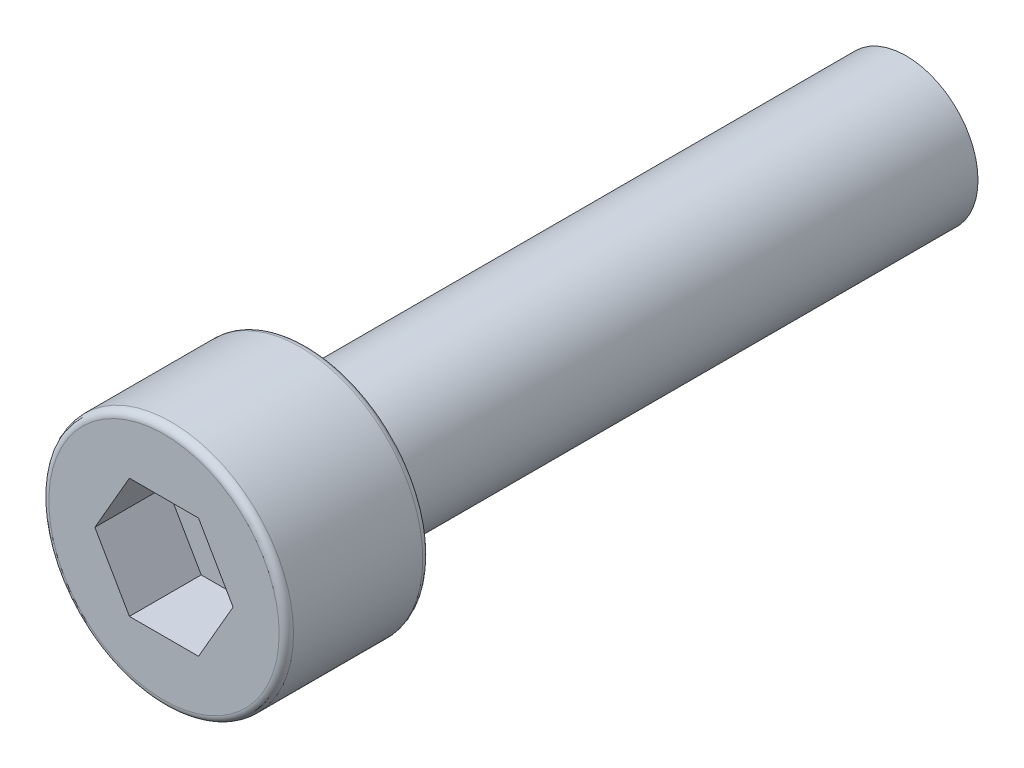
ISO-10303-21;
HEADER;
FILE_DESCRIPTION(('STEP AP214'),'2;1');
FILE_NAME('part.step','',(''),(''),'','','');
FILE_SCHEMA(('AUTOMOTIVE_DESIGN { 1 0 10303 214 1 1 1 1 }'));
ENDSEC;
DATA;
#1=APPLICATION_CONTEXT('core data for automotive mechanical design processes');
#2=APPLICATION_PROTOCOL_DEFINITION('international standard','automotive_design',2000,#1);
#3=PRODUCT_CONTEXT('',#1,'mechanical');
#4=PRODUCT('Part','Part','',(#3));
#5=PRODUCT_RELATED_PRODUCT_CATEGORY('part','',(#4));
#6=PRODUCT_DEFINITION_FORMATION('','',#4);
#7=PRODUCT_DEFINITION_CONTEXT('part definition',#1,'design');
#8=PRODUCT_DEFINITION('design','',#6,#7);
#9=PRODUCT_DEFINITION_SHAPE('','',#8);
#10=(LENGTH_UNIT() NAMED_UNIT(*) SI_UNIT(.MILLI.,.METRE.));
#11=(NAMED_UNIT(*) PLANE_ANGLE_UNIT() SI_UNIT($,.RADIAN.));
#12=(NAMED_UNIT(*) SI_UNIT($,.STERADIAN.) SOLID_ANGLE_UNIT());
#13=UNCERTAINTY_MEASURE_WITH_UNIT(LENGTH_MEASURE(1.E-05),#10,'distance_accuracy_value','');
#14=(GEOMETRIC_REPRESENTATION_CONTEXT(3) GLOBAL_UNCERTAINTY_ASSIGNED_CONTEXT((#13)) GLOBAL_UNIT_ASSIGNED_CONTEXT((#10,
#11,#12)) REPRESENTATION_CONTEXT('',''));
#15=CARTESIAN_POINT('',(0.,0.,0.));
#16=DIRECTION('',(0.,0.,1.));
#17=DIRECTION('',(1.,0.,0.));
#18=AXIS2_PLACEMENT_3D('',#15,#16,#17);
#19=CARTESIAN_POINT('',(0.,0.,25.));
#20=DIRECTION('',(0.,0.,-1.));
#21=DIRECTION('',(-1.,0.,0.));
#22=AXIS2_PLACEMENT_3D('',#19,#20,#21);
#23=CYLINDRICAL_SURFACE('',#22,3.);
#24=CARTESIAN_POINT('',(0.,0.,25.));
#25=DIRECTION('',(0.,0.,1.));
#26=DIRECTION('',(1.,0.,0.));
#27=AXIS2_PLACEMENT_3D('',#24,#25,#26);
#28=CIRCLE('',#27,3.);
#29=CARTESIAN_POINT('',(3.,0.,25.));
#30=VERTEX_POINT('',#29);
#31=EDGE_CURVE('E168',#30,#30,#28,.T.);
#32=ORIENTED_EDGE('',*,*,#31,.F.);
#33=EDGE_LOOP('',(#32));
#34=FACE_BOUND('',#33,.T.);
#35=CARTESIAN_POINT('',(0.,0.,0.));
#36=DIRECTION('',(0.,0.,1.));
#37=DIRECTION('',(1.,0.,0.));
#38=AXIS2_PLACEMENT_3D('',#35,#36,#37);
#39=CIRCLE('',#38,3.);
#40=CARTESIAN_POINT('',(3.,0.,0.));
#41=VERTEX_POINT('',#40);
#42=EDGE_CURVE('E159',#41,#41,#39,.T.);
#43=ORIENTED_EDGE('',*,*,#42,.T.);
#44=EDGE_LOOP('',(#43));
#45=FACE_BOUND('',#44,.T.);
#46=ADVANCED_FACE('F44',(#34,#45),#23,.T.);
#47=CARTESIAN_POINT('',(0.,0.,0.));
#48=DIRECTION('',(0.,0.,1.));
#49=DIRECTION('',(1.,0.,0.));
#50=AXIS2_PLACEMENT_3D('',#47,#48,#49);
#51=PLANE('',#50);
#52=ORIENTED_EDGE('',*,*,#42,.F.);
#53=EDGE_LOOP('',(#52));
#54=FACE_BOUND('',#53,.T.);
#55=ADVANCED_FACE('F199',(#54),#51,.F.);
#56=CARTESIAN_POINT('',(0.,0.,31.));
#57=DIRECTION('',(0.,0.,-1.));
#58=DIRECTION('',(-1.,0.,0.));
#59=AXIS2_PLACEMENT_3D('',#56,#57,#58);
#60=CYLINDRICAL_SURFACE('',#59,5.11);
#61=CARTESIAN_POINT('',(0.,0.,25.3));
#62=DIRECTION('',(0.,0.,1.));
#63=DIRECTION('',(1.,0.,0.));
#64=AXIS2_PLACEMENT_3D('',#61,#62,#63);
#65=CIRCLE('',#64,5.11);
#66=CARTESIAN_POINT('',(5.11,0.,25.3));
#67=VERTEX_POINT('',#66);
#68=EDGE_CURVE('E182',#67,#67,#65,.T.);
#69=ORIENTED_EDGE('',*,*,#68,.T.);
#70=EDGE_LOOP('',(#69));
#71=FACE_BOUND('',#70,.T.);
#72=CARTESIAN_POINT('',(0.,0.,30.7));
#73=DIRECTION('',(0.,0.,1.));
#74=DIRECTION('',(1.,0.,0.));
#75=AXIS2_PLACEMENT_3D('',#72,#73,#74);
#76=CIRCLE('',#75,5.11);
#77=CARTESIAN_POINT('',(5.11,0.,30.7));
#78=VERTEX_POINT('',#77);
#79=EDGE_CURVE('E171',#78,#78,#76,.F.);
#80=ORIENTED_EDGE('',*,*,#79,.T.);
#81=EDGE_LOOP('',(#80));
#82=FACE_BOUND('',#81,.T.);
#83=ADVANCED_FACE('F198',(#71,#82),#60,.T.);
#84=CARTESIAN_POINT('',(0.,0.,31.));
#85=DIRECTION('',(0.,0.,1.));
#86=DIRECTION('',(1.,0.,0.));
#87=AXIS2_PLACEMENT_3D('',#84,#85,#86);
#88=PLANE('',#87);
#89=CARTESIAN_POINT('',(0.,0.,31.));
#90=DIRECTION('',(0.,0.,1.));
#91=DIRECTION('',(1.,0.,0.));
#92=AXIS2_PLACEMENT_3D('',#89,#90,#91);
#93=CIRCLE('',#92,4.81);
#94=CARTESIAN_POINT('',(4.81,0.,31.));
#95=VERTEX_POINT('',#94);
#96=EDGE_CURVE('E11',#95,#95,#93,.T.);
#97=ORIENTED_EDGE('',*,*,#96,.T.);
#98=EDGE_LOOP('',(#97));
#99=FACE_BOUND('',#98,.T.);
#100=DIRECTION('',(0.5,0.866025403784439,0.));
#101=VECTOR('',#100,1.);
#102=CARTESIAN_POINT('',(1.44337567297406,-2.5,31.));
#103=LINE('',#102,#101);
#104=CARTESIAN_POINT('',(1.44337567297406,-2.5,31.));
#105=VERTEX_POINT('',#104);
#106=CARTESIAN_POINT('',(2.88675134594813,0.,31.));
#107=VERTEX_POINT('',#106);
#108=EDGE_CURVE('E62',#105,#107,#103,.T.);
#109=ORIENTED_EDGE('',*,*,#108,.F.);
#110=DIRECTION('',(1.,0.,0.));
#111=VECTOR('',#110,1.);
#112=CARTESIAN_POINT('',(-1.44337567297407,-2.5,31.));
#113=LINE('',#112,#111);
#114=CARTESIAN_POINT('',(-1.44337567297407,-2.5,31.));
#115=VERTEX_POINT('',#114);
#116=EDGE_CURVE('E152',#115,#105,#113,.T.);
#117=ORIENTED_EDGE('',*,*,#116,.F.);
#118=DIRECTION('',(0.5,-0.866025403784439,0.));
#119=VECTOR('',#118,1.);
#120=CARTESIAN_POINT('',(-2.88675134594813,0.,31.));
#121=LINE('',#120,#119);
#122=CARTESIAN_POINT('',(-2.88675134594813,0.,31.));
#123=VERTEX_POINT('',#122);
#124=EDGE_CURVE('E151',#123,#115,#121,.T.);
#125=ORIENTED_EDGE('',*,*,#124,.F.);
#126=DIRECTION('',(-0.5,-0.866025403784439,0.));
#127=VECTOR('',#126,1.);
#128=CARTESIAN_POINT('',(-1.44337567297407,2.5,31.));
#129=LINE('',#128,#127);
#130=CARTESIAN_POINT('',(-1.44337567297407,2.5,31.));
#131=VERTEX_POINT('',#130);
#132=EDGE_CURVE('E108',#131,#123,#129,.T.);
#133=ORIENTED_EDGE('',*,*,#132,.F.);
#134=DIRECTION('',(-1.,0.,0.));
#135=VECTOR('',#134,1.);
#136=CARTESIAN_POINT('',(1.44337567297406,2.5,31.));
#137=LINE('',#136,#135);
#138=CARTESIAN_POINT('',(1.44337567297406,2.5,31.));
#139=VERTEX_POINT('',#138);
#140=EDGE_CURVE('E144',#139,#131,#137,.T.);
#141=ORIENTED_EDGE('',*,*,#140,.F.);
#142=DIRECTION('',(-0.5,0.866025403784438,0.));
#143=VECTOR('',#142,1.);
#144=CARTESIAN_POINT('',(2.88675134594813,0.,31.));
#145=LINE('',#144,#143);
#146=EDGE_CURVE('E143',#107,#139,#145,.T.);
#147=ORIENTED_EDGE('',*,*,#146,.F.);
#148=EDGE_LOOP('',(#109,#117,#125,#133,#141,#147));
#149=FACE_BOUND('',#148,.T.);
#150=ADVANCED_FACE('F200',(#99,#149),#88,.T.);
#151=CARTESIAN_POINT('',(0.,0.,25.));
#152=DIRECTION('',(0.,0.,1.));
#153=DIRECTION('',(1.,0.,0.));
#154=AXIS2_PLACEMENT_3D('',#151,#152,#153);
#155=PLANE('',#154);
#156=CARTESIAN_POINT('',(0.,0.,25.));
#157=DIRECTION('',(0.,0.,1.));
#158=DIRECTION('',(1.,0.,0.));
#159=AXIS2_PLACEMENT_3D('',#156,#157,#158);
#160=CIRCLE('',#159,4.81);
#161=CARTESIAN_POINT('',(4.81,0.,25.));
#162=VERTEX_POINT('',#161);
#163=EDGE_CURVE('E53',#162,#162,#160,.F.);
#164=ORIENTED_EDGE('',*,*,#163,.T.);
#165=EDGE_LOOP('',(#164));
#166=FACE_BOUND('',#165,.T.);
#167=ORIENTED_EDGE('',*,*,#31,.T.);
#168=EDGE_LOOP('',(#167));
#169=FACE_BOUND('',#168,.T.);
#170=ADVANCED_FACE('F190',(#166,#169),#155,.F.);
#171=CARTESIAN_POINT('',(1.44337567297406,-2.5,28.));
#172=DIRECTION('',(0.866025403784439,-0.5,0.));
#173=DIRECTION('',(0.5,0.866025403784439,0.));
#174=AXIS2_PLACEMENT_3D('',#171,#172,#173);
#175=PLANE('',#174);
#176=ORIENTED_EDGE('',*,*,#108,.T.);
#177=DIRECTION('',(0.,0.,1.));
#178=VECTOR('',#177,1.);
#179=CARTESIAN_POINT('',(2.88675134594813,0.,28.));
#180=LINE('',#179,#178);
#181=CARTESIAN_POINT('',(2.88675134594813,0.,28.));
#182=VERTEX_POINT('',#181);
#183=EDGE_CURVE('E93',#182,#107,#180,.T.);
#184=ORIENTED_EDGE('',*,*,#183,.F.);
#185=DIRECTION('',(0.5,0.866025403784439,0.));
#186=VECTOR('',#185,1.);
#187=CARTESIAN_POINT('',(1.44337567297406,-2.5,28.));
#188=LINE('',#187,#186);
#189=CARTESIAN_POINT('',(1.44337567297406,-2.5,28.));
#190=VERTEX_POINT('',#189);
#191=EDGE_CURVE('E160',#190,#182,#188,.T.);
#192=ORIENTED_EDGE('',*,*,#191,.F.);
#193=DIRECTION('',(0.,0.,1.));
#194=VECTOR('',#193,1.);
#195=CARTESIAN_POINT('',(1.44337567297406,-2.5,28.));
#196=LINE('',#195,#194);
#197=EDGE_CURVE('E66',#190,#105,#196,.T.);
#198=ORIENTED_EDGE('',*,*,#197,.T.);
#199=EDGE_LOOP('',(#176,#184,#192,#198));
#200=FACE_BOUND('',#199,.T.);
#201=ADVANCED_FACE('F218',(#200),#175,.F.);
#202=CARTESIAN_POINT('',(-1.44337567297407,-2.5,28.));
#203=DIRECTION('',(0.,-1.,0.));
#204=DIRECTION('',(1.,0.,0.));
#205=AXIS2_PLACEMENT_3D('',#202,#203,#204);
#206=PLANE('',#205);
#207=ORIENTED_EDGE('',*,*,#116,.T.);
#208=ORIENTED_EDGE('',*,*,#197,.F.);
#209=DIRECTION('',(1.,0.,0.));
#210=VECTOR('',#209,1.);
#211=CARTESIAN_POINT('',(-1.44337567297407,-2.5,28.));
#212=LINE('',#211,#210);
#213=CARTESIAN_POINT('',(-1.44337567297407,-2.5,28.));
#214=VERTEX_POINT('',#213);
#215=EDGE_CURVE('E125',#214,#190,#212,.T.);
#216=ORIENTED_EDGE('',*,*,#215,.F.);
#217=DIRECTION('',(0.,0.,1.));
#218=VECTOR('',#217,1.);
#219=CARTESIAN_POINT('',(-1.44337567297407,-2.5,28.));
#220=LINE('',#219,#218);
#221=EDGE_CURVE('E111',#214,#115,#220,.T.);
#222=ORIENTED_EDGE('',*,*,#221,.T.);
#223=EDGE_LOOP('',(#207,#208,#216,#222));
#224=FACE_BOUND('',#223,.T.);
#225=ADVANCED_FACE('F222',(#224),#206,.F.);
#226=CARTESIAN_POINT('',(-2.88675134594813,0.,28.));
#227=DIRECTION('',(-0.866025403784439,-0.5,0.));
#228=DIRECTION('',(0.5,-0.866025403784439,0.));
#229=AXIS2_PLACEMENT_3D('',#226,#227,#228);
#230=PLANE('',#229);
#231=ORIENTED_EDGE('',*,*,#124,.T.);
#232=ORIENTED_EDGE('',*,*,#221,.F.);
#233=DIRECTION('',(0.5,-0.866025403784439,0.));
#234=VECTOR('',#233,1.);
#235=CARTESIAN_POINT('',(-2.88675134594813,0.,28.));
#236=LINE('',#235,#234);
#237=CARTESIAN_POINT('',(-2.88675134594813,0.,28.));
#238=VERTEX_POINT('',#237);
#239=EDGE_CURVE('E120',#238,#214,#236,.T.);
#240=ORIENTED_EDGE('',*,*,#239,.F.);
#241=DIRECTION('',(0.,0.,1.));
#242=VECTOR('',#241,1.);
#243=CARTESIAN_POINT('',(-2.88675134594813,0.,28.));
#244=LINE('',#243,#242);
#245=EDGE_CURVE('E105',#238,#123,#244,.T.);
#246=ORIENTED_EDGE('',*,*,#245,.T.);
#247=EDGE_LOOP('',(#231,#232,#240,#246));
#248=FACE_BOUND('',#247,.T.);
#249=ADVANCED_FACE('F116',(#248),#230,.F.);
#250=CARTESIAN_POINT('',(-1.44337567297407,2.5,28.));
#251=DIRECTION('',(-0.866025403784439,0.5,0.));
#252=DIRECTION('',(-0.5,-0.866025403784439,0.));
#253=AXIS2_PLACEMENT_3D('',#250,#251,#252);
#254=PLANE('',#253);
#255=ORIENTED_EDGE('',*,*,#132,.T.);
#256=ORIENTED_EDGE('',*,*,#245,.F.);
#257=DIRECTION('',(-0.5,-0.866025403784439,0.));
#258=VECTOR('',#257,1.);
#259=CARTESIAN_POINT('',(-1.44337567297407,2.5,28.));
#260=LINE('',#259,#258);
#261=CARTESIAN_POINT('',(-1.44337567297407,2.5,28.));
#262=VERTEX_POINT('',#261);
#263=EDGE_CURVE('E106',#262,#238,#260,.T.);
#264=ORIENTED_EDGE('',*,*,#263,.F.);
#265=DIRECTION('',(0.,0.,1.));
#266=VECTOR('',#265,1.);
#267=CARTESIAN_POINT('',(-1.44337567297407,2.5,28.));
#268=LINE('',#267,#266);
#269=EDGE_CURVE('E113',#262,#131,#268,.T.);
#270=ORIENTED_EDGE('',*,*,#269,.T.);
#271=EDGE_LOOP('',(#255,#256,#264,#270));
#272=FACE_BOUND('',#271,.T.);
#273=ADVANCED_FACE('F102',(#272),#254,.F.);
#274=CARTESIAN_POINT('',(1.44337567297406,2.5,28.));
#275=DIRECTION('',(0.,1.,0.));
#276=DIRECTION('',(0.,0.,1.));
#277=AXIS2_PLACEMENT_3D('',#274,#275,#276);
#278=PLANE('',#277);
#279=ORIENTED_EDGE('',*,*,#140,.T.);
#280=ORIENTED_EDGE('',*,*,#269,.F.);
#281=DIRECTION('',(-1.,0.,0.));
#282=VECTOR('',#281,1.);
#283=CARTESIAN_POINT('',(1.44337567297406,2.5,28.));
#284=LINE('',#283,#282);
#285=CARTESIAN_POINT('',(1.44337567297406,2.5,28.));
#286=VERTEX_POINT('',#285);
#287=EDGE_CURVE('E129',#286,#262,#284,.T.);
#288=ORIENTED_EDGE('',*,*,#287,.F.);
#289=DIRECTION('',(0.,0.,1.));
#290=VECTOR('',#289,1.);
#291=CARTESIAN_POINT('',(1.44337567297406,2.5,28.));
#292=LINE('',#291,#290);
#293=EDGE_CURVE('E164',#286,#139,#292,.T.);
#294=ORIENTED_EDGE('',*,*,#293,.T.);
#295=EDGE_LOOP('',(#279,#280,#288,#294));
#296=FACE_BOUND('',#295,.T.);
#297=ADVANCED_FACE('F291',(#296),#278,.F.);
#298=CARTESIAN_POINT('',(2.88675134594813,0.,28.));
#299=DIRECTION('',(0.866025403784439,0.5,0.));
#300=DIRECTION('',(-0.5,0.866025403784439,0.));
#301=AXIS2_PLACEMENT_3D('',#298,#299,#300);
#302=PLANE('',#301);
#303=ORIENTED_EDGE('',*,*,#146,.T.);
#304=ORIENTED_EDGE('',*,*,#293,.F.);
#305=DIRECTION('',(-0.5,0.866025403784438,0.));
#306=VECTOR('',#305,1.);
#307=CARTESIAN_POINT('',(2.88675134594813,0.,28.));
#308=LINE('',#307,#306);
#309=EDGE_CURVE('E135',#182,#286,#308,.T.);
#310=ORIENTED_EDGE('',*,*,#309,.F.);
#311=ORIENTED_EDGE('',*,*,#183,.T.);
#312=EDGE_LOOP('',(#303,#304,#310,#311));
#313=FACE_BOUND('',#312,.T.);
#314=ADVANCED_FACE('F214',(#313),#302,.F.);
#315=CARTESIAN_POINT('',(0.,0.,28.));
#316=DIRECTION('',(0.,0.,1.));
#317=DIRECTION('',(1.,0.,0.));
#318=AXIS2_PLACEMENT_3D('',#315,#316,#317);
#319=PLANE('',#318);
#320=ORIENTED_EDGE('',*,*,#191,.T.);
#321=ORIENTED_EDGE('',*,*,#309,.T.);
#322=ORIENTED_EDGE('',*,*,#287,.T.);
#323=ORIENTED_EDGE('',*,*,#263,.T.);
#324=ORIENTED_EDGE('',*,*,#239,.T.);
#325=ORIENTED_EDGE('',*,*,#215,.T.);
#326=EDGE_LOOP('',(#320,#321,#322,#323,#324,#325));
#327=FACE_BOUND('',#326,.T.);
#328=ADVANCED_FACE('F127',(#327),#319,.T.);
#329=CARTESIAN_POINT('',(0.,0.,25.3));
#330=DIRECTION('',(0.,0.,1.));
#331=DIRECTION('',(1.,0.,0.));
#332=AXIS2_PLACEMENT_3D('',#329,#330,#331);
#333=TOROIDAL_SURFACE('',#332,4.81,0.3);
#334=ORIENTED_EDGE('',*,*,#163,.F.);
#335=EDGE_LOOP('',(#334));
#336=FACE_BOUND('',#335,.T.);
#337=ORIENTED_EDGE('',*,*,#68,.F.);
#338=EDGE_LOOP('',(#337));
#339=FACE_BOUND('',#338,.T.);
#340=ADVANCED_FACE('F192',(#336,#339),#333,.T.);
#341=CARTESIAN_POINT('',(0.,0.,30.7));
#342=DIRECTION('',(0.,0.,1.));
#343=DIRECTION('',(1.,0.,0.));
#344=AXIS2_PLACEMENT_3D('',#341,#342,#343);
#345=TOROIDAL_SURFACE('',#344,4.81,0.3);
#346=ORIENTED_EDGE('',*,*,#79,.F.);
#347=EDGE_LOOP('',(#346));
#348=FACE_BOUND('',#347,.T.);
#349=ORIENTED_EDGE('',*,*,#96,.F.);
#350=EDGE_LOOP('',(#349));
#351=FACE_BOUND('',#350,.T.);
#352=ADVANCED_FACE('F50',(#348,#351),#345,.T.);
#353=CLOSED_SHELL('',(#46,#55,#83,#150,#170,#201,#225,#249,#273,#297,#314,#328,#340,#352));
#354=MANIFOLD_SOLID_BREP('B2',#353);
#355=ADVANCED_BREP_SHAPE_REPRESENTATION('',(#18,#354),#14);
#356=SHAPE_DEFINITION_REPRESENTATION(#9,#355);
ENDSEC;
END-ISO-10303-21;
